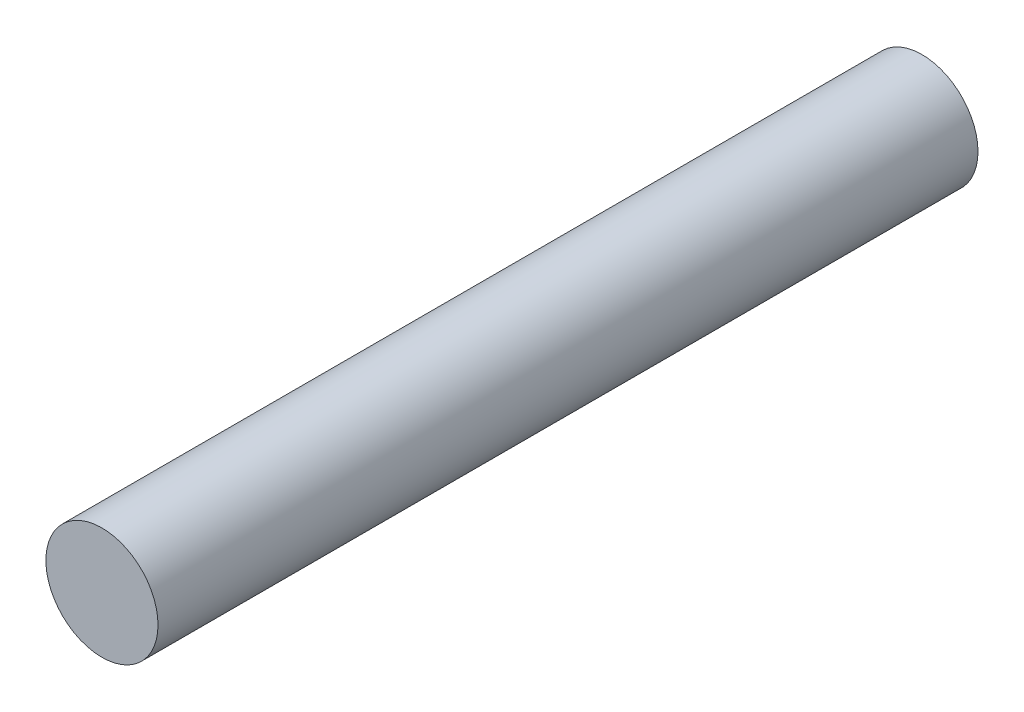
from build123d import *

# Parameters (mm, degrees)
SKETCH1_R           = 2.3876
BOSS_EXTRUDE1_DEPTH = 17.4625


with BuildPart() as part:
    # Sketch1 → Boss-Extrude1 (new, symmetric)
    with BuildSketch(Plane.XY):
        Circle(SKETCH1_R)
    extrude(amount=BOSS_EXTRUDE1_DEPTH, both=True)


solid = part.part
